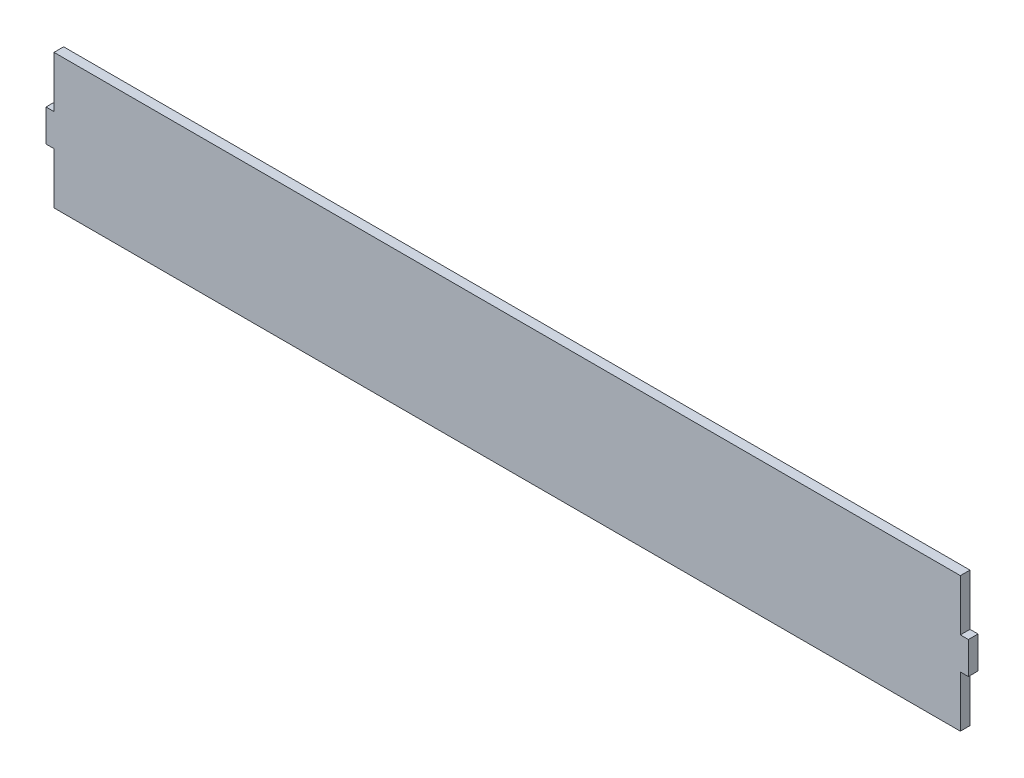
from build123d import *

# Parameters (mm, degrees)
EXTRUDE1_DEPTH = 3.81


with BuildPart() as part:
    # Sketch1 → Extrude1 (new body)
    with BuildSketch(Plane.XY):
        Polygon((-110.233637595, 12.7), (-110.233637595, 33.02), (248.541362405, 33.02), (248.541362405, 12.7), (251.716362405, 12.7), (251.716362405, 0), (248.541362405, 0), (248.541362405, -20.32), (-110.233637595, -20.32), (-110.233637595, 0), (-113.408637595, 0), (-113.408637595, 12.7), align=None)
    extrude(amount=EXTRUDE1_DEPTH)


solid = part.part
